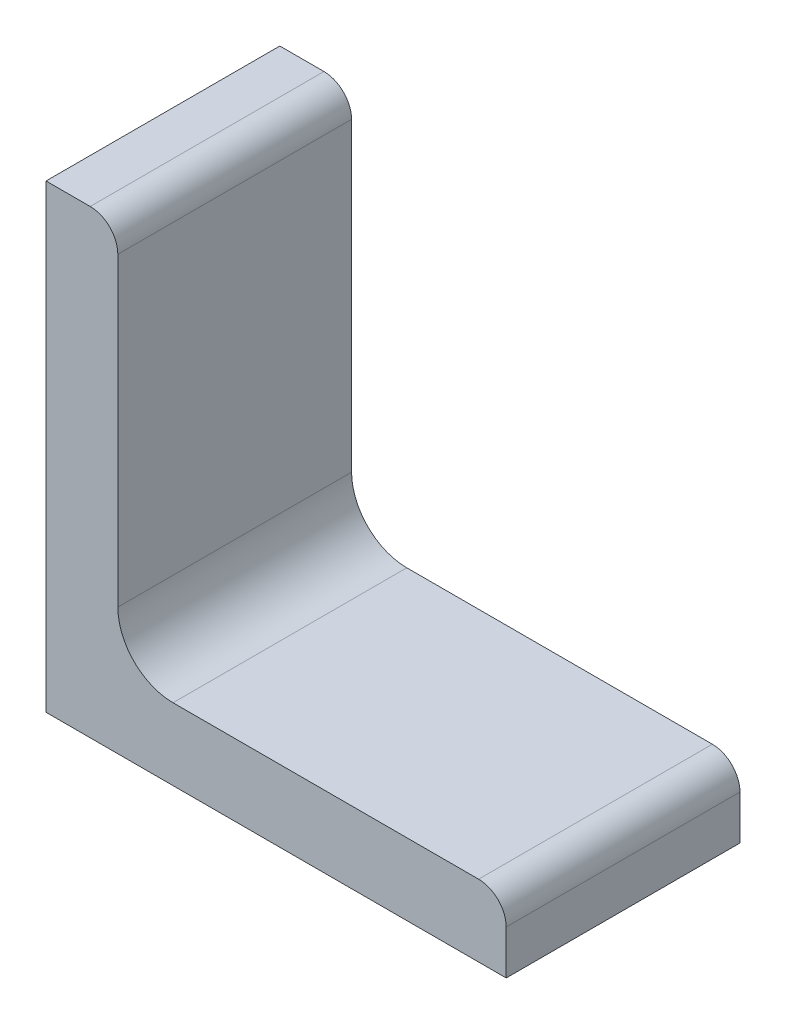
ISO-10303-21;
HEADER;
FILE_DESCRIPTION(('STEP AP214'),'2;1');
FILE_NAME('part.step','',(''),(''),'','','');
FILE_SCHEMA(('AUTOMOTIVE_DESIGN { 1 0 10303 214 1 1 1 1 }'));
ENDSEC;
DATA;
#1=APPLICATION_CONTEXT('core data for automotive mechanical design processes');
#2=APPLICATION_PROTOCOL_DEFINITION('international standard','automotive_design',2000,#1);
#3=PRODUCT_CONTEXT('',#1,'mechanical');
#4=PRODUCT('Part','Part','',(#3));
#5=PRODUCT_RELATED_PRODUCT_CATEGORY('part','',(#4));
#6=PRODUCT_DEFINITION_FORMATION('','',#4);
#7=PRODUCT_DEFINITION_CONTEXT('part definition',#1,'design');
#8=PRODUCT_DEFINITION('design','',#6,#7);
#9=PRODUCT_DEFINITION_SHAPE('','',#8);
#10=(LENGTH_UNIT() NAMED_UNIT(*) SI_UNIT(.MILLI.,.METRE.));
#11=(NAMED_UNIT(*) PLANE_ANGLE_UNIT() SI_UNIT($,.RADIAN.));
#12=(NAMED_UNIT(*) SI_UNIT($,.STERADIAN.) SOLID_ANGLE_UNIT());
#13=UNCERTAINTY_MEASURE_WITH_UNIT(LENGTH_MEASURE(1.E-05),#10,'distance_accuracy_value','');
#14=(GEOMETRIC_REPRESENTATION_CONTEXT(3) GLOBAL_UNCERTAINTY_ASSIGNED_CONTEXT((#13)) GLOBAL_UNIT_ASSIGNED_CONTEXT((#10,
#11,#12)) REPRESENTATION_CONTEXT('',''));
#15=CARTESIAN_POINT('',(0.,0.,0.));
#16=DIRECTION('',(0.,0.,1.));
#17=DIRECTION('',(1.,0.,0.));
#18=AXIS2_PLACEMENT_3D('',#15,#16,#17);
#19=CARTESIAN_POINT('',(0.,0.,12.7));
#20=DIRECTION('',(1.,0.,0.));
#21=DIRECTION('',(0.,0.,-1.));
#22=AXIS2_PLACEMENT_3D('',#19,#20,#21);
#23=PLANE('',#22);
#24=DIRECTION('',(0.,-1.,0.));
#25=VECTOR('',#24,1.);
#26=CARTESIAN_POINT('',(0.,0.,-12.7));
#27=LINE('',#26,#25);
#28=CARTESIAN_POINT('',(0.,50.,-12.7));
#29=VERTEX_POINT('',#28);
#30=CARTESIAN_POINT('',(0.,0.,-12.7));
#31=VERTEX_POINT('',#30);
#32=EDGE_CURVE('E142',#29,#31,#27,.T.);
#33=ORIENTED_EDGE('',*,*,#32,.T.);
#34=DIRECTION('',(0.,0.,-1.));
#35=VECTOR('',#34,1.);
#36=CARTESIAN_POINT('',(0.,0.,12.7));
#37=LINE('',#36,#35);
#38=CARTESIAN_POINT('',(0.,0.,12.7));
#39=VERTEX_POINT('',#38);
#40=EDGE_CURVE('E11',#39,#31,#37,.T.);
#41=ORIENTED_EDGE('',*,*,#40,.F.);
#42=DIRECTION('',(0.,-1.,0.));
#43=VECTOR('',#42,1.);
#44=CARTESIAN_POINT('',(0.,0.,12.7));
#45=LINE('',#44,#43);
#46=CARTESIAN_POINT('',(0.,50.,12.7));
#47=VERTEX_POINT('',#46);
#48=EDGE_CURVE('E156',#47,#39,#45,.T.);
#49=ORIENTED_EDGE('',*,*,#48,.F.);
#50=DIRECTION('',(0.,0.,-1.));
#51=VECTOR('',#50,1.);
#52=CARTESIAN_POINT('',(0.,50.,12.7));
#53=LINE('',#52,#51);
#54=EDGE_CURVE('E136',#47,#29,#53,.T.);
#55=ORIENTED_EDGE('',*,*,#54,.T.);
#56=EDGE_LOOP('',(#33,#41,#49,#55));
#57=FACE_BOUND('',#56,.T.);
#58=ADVANCED_FACE('F39',(#57),#23,.F.);
#59=CARTESIAN_POINT('',(0.,0.,12.7));
#60=DIRECTION('',(0.,1.,0.));
#61=DIRECTION('',(0.,0.,1.));
#62=AXIS2_PLACEMENT_3D('',#59,#60,#61);
#63=PLANE('',#62);
#64=DIRECTION('',(1.,0.,0.));
#65=VECTOR('',#64,1.);
#66=CARTESIAN_POINT('',(0.,0.,-12.7));
#67=LINE('',#66,#65);
#68=CARTESIAN_POINT('',(50.,0.,-12.7));
#69=VERTEX_POINT('',#68);
#70=EDGE_CURVE('E144',#31,#69,#67,.T.);
#71=ORIENTED_EDGE('',*,*,#70,.T.);
#72=DIRECTION('',(0.,0.,-1.));
#73=VECTOR('',#72,1.);
#74=CARTESIAN_POINT('',(50.,0.,12.7));
#75=LINE('',#74,#73);
#76=CARTESIAN_POINT('',(50.,0.,12.7));
#77=VERTEX_POINT('',#76);
#78=EDGE_CURVE('E50',#77,#69,#75,.T.);
#79=ORIENTED_EDGE('',*,*,#78,.F.);
#80=DIRECTION('',(1.,0.,0.));
#81=VECTOR('',#80,1.);
#82=CARTESIAN_POINT('',(0.,0.,12.7));
#83=LINE('',#82,#81);
#84=EDGE_CURVE('E103',#39,#77,#83,.T.);
#85=ORIENTED_EDGE('',*,*,#84,.F.);
#86=ORIENTED_EDGE('',*,*,#40,.T.);
#87=EDGE_LOOP('',(#71,#79,#85,#86));
#88=FACE_BOUND('',#87,.T.);
#89=ADVANCED_FACE('F200',(#88),#63,.F.);
#90=CARTESIAN_POINT('',(50.,0.,12.7));
#91=DIRECTION('',(-1.,0.,0.));
#92=DIRECTION('',(0.,0.,1.));
#93=AXIS2_PLACEMENT_3D('',#90,#91,#92);
#94=PLANE('',#93);
#95=DIRECTION('',(0.,1.,0.));
#96=VECTOR('',#95,1.);
#97=CARTESIAN_POINT('',(50.,0.,-12.7));
#98=LINE('',#97,#96);
#99=CARTESIAN_POINT('',(50.,4.79999999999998,-12.7));
#100=VERTEX_POINT('',#99);
#101=EDGE_CURVE('E147',#69,#100,#98,.T.);
#102=ORIENTED_EDGE('',*,*,#101,.T.);
#103=DIRECTION('',(0.,0.,-1.));
#104=VECTOR('',#103,1.);
#105=CARTESIAN_POINT('',(50.,4.79999999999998,12.7));
#106=LINE('',#105,#104);
#107=CARTESIAN_POINT('',(50.,4.79999999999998,12.7));
#108=VERTEX_POINT('',#107);
#109=EDGE_CURVE('E170',#108,#100,#106,.T.);
#110=ORIENTED_EDGE('',*,*,#109,.F.);
#111=DIRECTION('',(0.,1.,0.));
#112=VECTOR('',#111,1.);
#113=CARTESIAN_POINT('',(50.,0.,12.7));
#114=LINE('',#113,#112);
#115=EDGE_CURVE('E174',#77,#108,#114,.T.);
#116=ORIENTED_EDGE('',*,*,#115,.F.);
#117=ORIENTED_EDGE('',*,*,#78,.T.);
#118=EDGE_LOOP('',(#102,#110,#116,#117));
#119=FACE_BOUND('',#118,.T.);
#120=ADVANCED_FACE('F173',(#119),#94,.F.);
#121=CARTESIAN_POINT('',(47.,4.8,12.7));
#122=DIRECTION('',(0.,0.,-1.));
#123=DIRECTION('',(-1.,0.,0.));
#124=AXIS2_PLACEMENT_3D('',#121,#122,#123);
#125=CYLINDRICAL_SURFACE('',#124,3.);
#126=CARTESIAN_POINT('',(47.,4.8,-12.7));
#127=DIRECTION('',(0.,0.,1.));
#128=DIRECTION('',(1.,0.,0.));
#129=AXIS2_PLACEMENT_3D('',#126,#127,#128);
#130=CIRCLE('',#129,3.);
#131=CARTESIAN_POINT('',(47.,7.8,-12.7));
#132=VERTEX_POINT('',#131);
#133=EDGE_CURVE('E149',#100,#132,#130,.T.);
#134=ORIENTED_EDGE('',*,*,#133,.T.);
#135=DIRECTION('',(0.,0.,-1.));
#136=VECTOR('',#135,1.);
#137=CARTESIAN_POINT('',(47.,7.8,12.7));
#138=LINE('',#137,#136);
#139=CARTESIAN_POINT('',(47.,7.8,12.7));
#140=VERTEX_POINT('',#139);
#141=EDGE_CURVE('E165',#140,#132,#138,.T.);
#142=ORIENTED_EDGE('',*,*,#141,.F.);
#143=CARTESIAN_POINT('',(47.,4.8,12.7));
#144=DIRECTION('',(0.,0.,1.));
#145=DIRECTION('',(1.,0.,0.));
#146=AXIS2_PLACEMENT_3D('',#143,#144,#145);
#147=CIRCLE('',#146,3.);
#148=EDGE_CURVE('E192',#108,#140,#147,.T.);
#149=ORIENTED_EDGE('',*,*,#148,.F.);
#150=ORIENTED_EDGE('',*,*,#109,.T.);
#151=EDGE_LOOP('',(#134,#142,#149,#150));
#152=FACE_BOUND('',#151,.T.);
#153=ADVANCED_FACE('F183',(#152),#125,.T.);
#154=CARTESIAN_POINT('',(13.8,7.8,12.7));
#155=DIRECTION('',(0.,-1.,0.));
#156=DIRECTION('',(1.,0.,0.));
#157=AXIS2_PLACEMENT_3D('',#154,#155,#156);
#158=PLANE('',#157);
#159=DIRECTION('',(-1.,0.,0.));
#160=VECTOR('',#159,1.);
#161=CARTESIAN_POINT('',(13.8,7.8,-12.7));
#162=LINE('',#161,#160);
#163=CARTESIAN_POINT('',(13.8,7.8,-12.7));
#164=VERTEX_POINT('',#163);
#165=EDGE_CURVE('E148',#132,#164,#162,.T.);
#166=ORIENTED_EDGE('',*,*,#165,.T.);
#167=DIRECTION('',(0.,0.,-1.));
#168=VECTOR('',#167,1.);
#169=CARTESIAN_POINT('',(13.8,7.8,12.7));
#170=LINE('',#169,#168);
#171=CARTESIAN_POINT('',(13.8,7.8,12.7));
#172=VERTEX_POINT('',#171);
#173=EDGE_CURVE('E163',#172,#164,#170,.T.);
#174=ORIENTED_EDGE('',*,*,#173,.F.);
#175=DIRECTION('',(-1.,0.,0.));
#176=VECTOR('',#175,1.);
#177=CARTESIAN_POINT('',(13.8,7.8,12.7));
#178=LINE('',#177,#176);
#179=EDGE_CURVE('E188',#140,#172,#178,.T.);
#180=ORIENTED_EDGE('',*,*,#179,.F.);
#181=ORIENTED_EDGE('',*,*,#141,.T.);
#182=EDGE_LOOP('',(#166,#174,#180,#181));
#183=FACE_BOUND('',#182,.T.);
#184=ADVANCED_FACE('F189',(#183),#158,.F.);
#185=CARTESIAN_POINT('',(13.8,13.8,12.7));
#186=DIRECTION('',(0.,0.,-1.));
#187=DIRECTION('',(-1.,0.,0.));
#188=AXIS2_PLACEMENT_3D('',#185,#186,#187);
#189=CYLINDRICAL_SURFACE('',#188,6.);
#190=CARTESIAN_POINT('',(13.8,13.8,-12.7));
#191=DIRECTION('',(0.,0.,-1.));
#192=DIRECTION('',(1.,0.,0.));
#193=AXIS2_PLACEMENT_3D('',#190,#191,#192);
#194=CIRCLE('',#193,6.);
#195=CARTESIAN_POINT('',(7.80000000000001,13.8,-12.7));
#196=VERTEX_POINT('',#195);
#197=EDGE_CURVE('E152',#164,#196,#194,.T.);
#198=ORIENTED_EDGE('',*,*,#197,.T.);
#199=DIRECTION('',(0.,0.,-1.));
#200=VECTOR('',#199,1.);
#201=CARTESIAN_POINT('',(7.80000000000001,13.8,12.7));
#202=LINE('',#201,#200);
#203=CARTESIAN_POINT('',(7.80000000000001,13.8,12.7));
#204=VERTEX_POINT('',#203);
#205=EDGE_CURVE('E132',#204,#196,#202,.T.);
#206=ORIENTED_EDGE('',*,*,#205,.F.);
#207=CARTESIAN_POINT('',(13.8,13.8,12.7));
#208=DIRECTION('',(0.,0.,-1.));
#209=DIRECTION('',(1.,0.,0.));
#210=AXIS2_PLACEMENT_3D('',#207,#208,#209);
#211=CIRCLE('',#210,6.);
#212=EDGE_CURVE('E124',#172,#204,#211,.T.);
#213=ORIENTED_EDGE('',*,*,#212,.F.);
#214=ORIENTED_EDGE('',*,*,#173,.T.);
#215=EDGE_LOOP('',(#198,#206,#213,#214));
#216=FACE_BOUND('',#215,.T.);
#217=ADVANCED_FACE('F215',(#216),#189,.F.);
#218=CARTESIAN_POINT('',(7.8,47.,12.7));
#219=DIRECTION('',(-1.,0.,0.));
#220=DIRECTION('',(0.,-1.,0.));
#221=AXIS2_PLACEMENT_3D('',#218,#219,#220);
#222=PLANE('',#221);
#223=DIRECTION('',(0.,1.,0.));
#224=VECTOR('',#223,1.);
#225=CARTESIAN_POINT('',(7.8,47.,-12.7));
#226=LINE('',#225,#224);
#227=CARTESIAN_POINT('',(7.8,47.,-12.7));
#228=VERTEX_POINT('',#227);
#229=EDGE_CURVE('E131',#196,#228,#226,.T.);
#230=ORIENTED_EDGE('',*,*,#229,.T.);
#231=DIRECTION('',(0.,0.,-1.));
#232=VECTOR('',#231,1.);
#233=CARTESIAN_POINT('',(7.8,47.,12.7));
#234=LINE('',#233,#232);
#235=CARTESIAN_POINT('',(7.8,47.,12.7));
#236=VERTEX_POINT('',#235);
#237=EDGE_CURVE('E129',#236,#228,#234,.T.);
#238=ORIENTED_EDGE('',*,*,#237,.F.);
#239=DIRECTION('',(0.,1.,0.));
#240=VECTOR('',#239,1.);
#241=CARTESIAN_POINT('',(7.8,47.,12.7));
#242=LINE('',#241,#240);
#243=EDGE_CURVE('E120',#204,#236,#242,.T.);
#244=ORIENTED_EDGE('',*,*,#243,.F.);
#245=ORIENTED_EDGE('',*,*,#205,.T.);
#246=EDGE_LOOP('',(#230,#238,#244,#245));
#247=FACE_BOUND('',#246,.T.);
#248=ADVANCED_FACE('F126',(#247),#222,.F.);
#249=CARTESIAN_POINT('',(4.8,47.,12.7));
#250=DIRECTION('',(0.,0.,-1.));
#251=DIRECTION('',(-1.,0.,0.));
#252=AXIS2_PLACEMENT_3D('',#249,#250,#251);
#253=CYLINDRICAL_SURFACE('',#252,3.);
#254=CARTESIAN_POINT('',(4.8,47.,-12.7));
#255=DIRECTION('',(0.,0.,1.));
#256=DIRECTION('',(-1.,0.,0.));
#257=AXIS2_PLACEMENT_3D('',#254,#255,#256);
#258=CIRCLE('',#257,3.);
#259=CARTESIAN_POINT('',(4.8,50.,-12.7));
#260=VERTEX_POINT('',#259);
#261=EDGE_CURVE('E87',#228,#260,#258,.T.);
#262=ORIENTED_EDGE('',*,*,#261,.T.);
#263=DIRECTION('',(0.,0.,-1.));
#264=VECTOR('',#263,1.);
#265=CARTESIAN_POINT('',(4.8,50.,12.7));
#266=LINE('',#265,#264);
#267=CARTESIAN_POINT('',(4.8,50.,12.7));
#268=VERTEX_POINT('',#267);
#269=EDGE_CURVE('E134',#268,#260,#266,.T.);
#270=ORIENTED_EDGE('',*,*,#269,.F.);
#271=CARTESIAN_POINT('',(4.8,47.,12.7));
#272=DIRECTION('',(0.,0.,1.));
#273=DIRECTION('',(-1.,0.,0.));
#274=AXIS2_PLACEMENT_3D('',#271,#272,#273);
#275=CIRCLE('',#274,3.);
#276=EDGE_CURVE('E122',#236,#268,#275,.T.);
#277=ORIENTED_EDGE('',*,*,#276,.F.);
#278=ORIENTED_EDGE('',*,*,#237,.T.);
#279=EDGE_LOOP('',(#262,#270,#277,#278));
#280=FACE_BOUND('',#279,.T.);
#281=ADVANCED_FACE('F135',(#280),#253,.T.);
#282=CARTESIAN_POINT('',(0.,50.,12.7));
#283=DIRECTION('',(0.,-1.,0.));
#284=DIRECTION('',(0.,0.,-1.));
#285=AXIS2_PLACEMENT_3D('',#282,#283,#284);
#286=PLANE('',#285);
#287=DIRECTION('',(-1.,0.,0.));
#288=VECTOR('',#287,1.);
#289=CARTESIAN_POINT('',(0.,50.,-12.7));
#290=LINE('',#289,#288);
#291=EDGE_CURVE('E95',#260,#29,#290,.T.);
#292=ORIENTED_EDGE('',*,*,#291,.T.);
#293=ORIENTED_EDGE('',*,*,#54,.F.);
#294=DIRECTION('',(-1.,0.,0.));
#295=VECTOR('',#294,1.);
#296=CARTESIAN_POINT('',(0.,50.,12.7));
#297=LINE('',#296,#295);
#298=EDGE_CURVE('E54',#268,#47,#297,.T.);
#299=ORIENTED_EDGE('',*,*,#298,.F.);
#300=ORIENTED_EDGE('',*,*,#269,.T.);
#301=EDGE_LOOP('',(#292,#293,#299,#300));
#302=FACE_BOUND('',#301,.T.);
#303=ADVANCED_FACE('F220',(#302),#286,.F.);
#304=CARTESIAN_POINT('',(4.8,47.,12.7));
#305=DIRECTION('',(0.,0.,-1.));
#306=DIRECTION('',(-1.,0.,0.));
#307=AXIS2_PLACEMENT_3D('',#304,#305,#306);
#308=PLANE('',#307);
#309=ORIENTED_EDGE('',*,*,#48,.T.);
#310=ORIENTED_EDGE('',*,*,#84,.T.);
#311=ORIENTED_EDGE('',*,*,#115,.T.);
#312=ORIENTED_EDGE('',*,*,#148,.T.);
#313=ORIENTED_EDGE('',*,*,#179,.T.);
#314=ORIENTED_EDGE('',*,*,#212,.T.);
#315=ORIENTED_EDGE('',*,*,#243,.T.);
#316=ORIENTED_EDGE('',*,*,#276,.T.);
#317=ORIENTED_EDGE('',*,*,#298,.T.);
#318=EDGE_LOOP('',(#309,#310,#311,#312,#313,#314,#315,#316,#317));
#319=FACE_BOUND('',#318,.T.);
#320=ADVANCED_FACE('F118',(#319),#308,.F.);
#321=CARTESIAN_POINT('',(4.8,47.,-12.7));
#322=DIRECTION('',(0.,0.,-1.));
#323=DIRECTION('',(-1.,0.,0.));
#324=AXIS2_PLACEMENT_3D('',#321,#322,#323);
#325=PLANE('',#324);
#326=ORIENTED_EDGE('',*,*,#32,.F.);
#327=ORIENTED_EDGE('',*,*,#291,.F.);
#328=ORIENTED_EDGE('',*,*,#261,.F.);
#329=ORIENTED_EDGE('',*,*,#229,.F.);
#330=ORIENTED_EDGE('',*,*,#197,.F.);
#331=ORIENTED_EDGE('',*,*,#165,.F.);
#332=ORIENTED_EDGE('',*,*,#133,.F.);
#333=ORIENTED_EDGE('',*,*,#101,.F.);
#334=ORIENTED_EDGE('',*,*,#70,.F.);
#335=EDGE_LOOP('',(#326,#327,#328,#329,#330,#331,#332,#333,#334));
#336=FACE_BOUND('',#335,.T.);
#337=ADVANCED_FACE('F177',(#336),#325,.T.);
#338=CLOSED_SHELL('',(#58,#89,#120,#153,#184,#217,#248,#281,#303,#320,#337));
#339=MANIFOLD_SOLID_BREP('B2',#338);
#340=ADVANCED_BREP_SHAPE_REPRESENTATION('',(#18,#339),#14);
#341=SHAPE_DEFINITION_REPRESENTATION(#9,#340);
ENDSEC;
END-ISO-10303-21;
